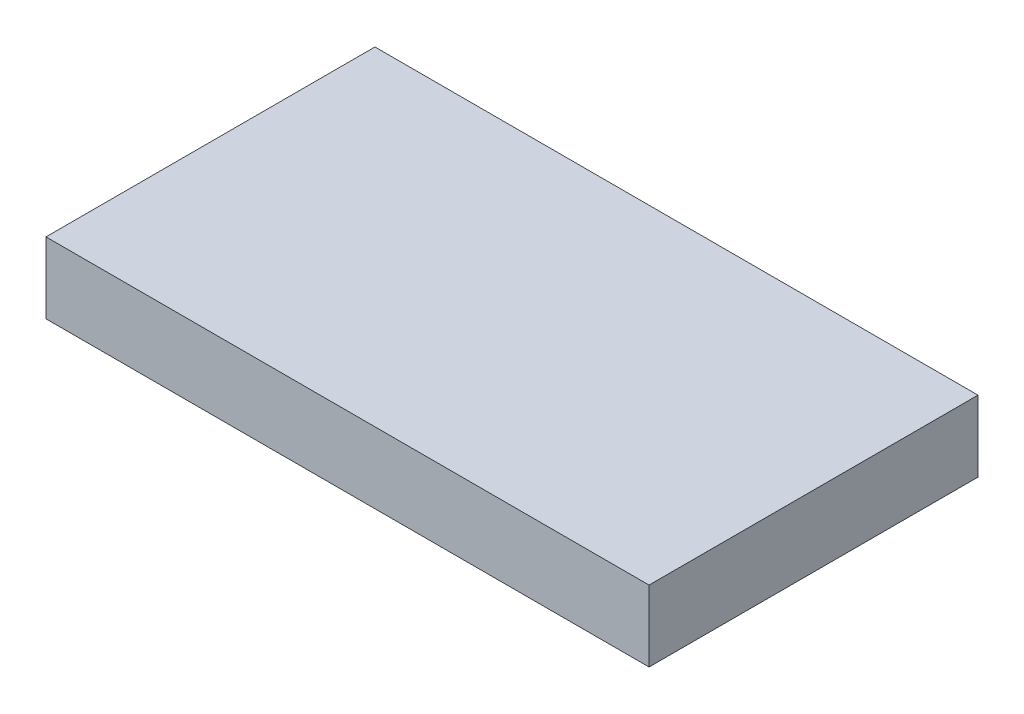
ISO-10303-21;
HEADER;
FILE_DESCRIPTION(('STEP AP214'),'2;1');
FILE_NAME('part.step','',(''),(''),'','','');
FILE_SCHEMA(('AUTOMOTIVE_DESIGN { 1 0 10303 214 1 1 1 1 }'));
ENDSEC;
DATA;
#1=APPLICATION_CONTEXT('core data for automotive mechanical design processes');
#2=APPLICATION_PROTOCOL_DEFINITION('international standard','automotive_design',2000,#1);
#3=PRODUCT_CONTEXT('',#1,'mechanical');
#4=PRODUCT('Part','Part','',(#3));
#5=PRODUCT_RELATED_PRODUCT_CATEGORY('part','',(#4));
#6=PRODUCT_DEFINITION_FORMATION('','',#4);
#7=PRODUCT_DEFINITION_CONTEXT('part definition',#1,'design');
#8=PRODUCT_DEFINITION('design','',#6,#7);
#9=PRODUCT_DEFINITION_SHAPE('','',#8);
#10=(LENGTH_UNIT() NAMED_UNIT(*) SI_UNIT(.MILLI.,.METRE.));
#11=(NAMED_UNIT(*) PLANE_ANGLE_UNIT() SI_UNIT($,.RADIAN.));
#12=(NAMED_UNIT(*) SI_UNIT($,.STERADIAN.) SOLID_ANGLE_UNIT());
#13=UNCERTAINTY_MEASURE_WITH_UNIT(LENGTH_MEASURE(1.E-05),#10,'distance_accuracy_value','');
#14=(GEOMETRIC_REPRESENTATION_CONTEXT(3) GLOBAL_UNCERTAINTY_ASSIGNED_CONTEXT((#13)) GLOBAL_UNIT_ASSIGNED_CONTEXT((#10,
#11,#12)) REPRESENTATION_CONTEXT('',''));
#15=CARTESIAN_POINT('',(0.,0.,0.));
#16=DIRECTION('',(0.,0.,1.));
#17=DIRECTION('',(1.,0.,0.));
#18=AXIS2_PLACEMENT_3D('',#15,#16,#17);
#19=CARTESIAN_POINT('',(0.,1.27000004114E-06,1.20000014));
#20=DIRECTION('',(0.,0.,-1.));
#21=DIRECTION('',(0.,-1.,0.));
#22=AXIS2_PLACEMENT_3D('',#19,#20,#21);
#23=PLANE('',#22);
#24=DIRECTION('',(1.,0.,0.));
#25=VECTOR('',#24,1.);
#26=CARTESIAN_POINT('',(-1.10000034,0.1295019,1.20000014));
#27=LINE('',#26,#25);
#28=CARTESIAN_POINT('',(-1.10000034,0.1295019,1.20000014));
#29=VERTEX_POINT('',#28);
#30=CARTESIAN_POINT('',(1.10000034,0.1295019,1.20000014));
#31=VERTEX_POINT('',#30);
#32=EDGE_CURVE('E20',#29,#31,#27,.T.);
#33=ORIENTED_EDGE('',*,*,#32,.F.);
#34=DIRECTION('',(0.,1.,0.));
#35=VECTOR('',#34,1.);
#36=CARTESIAN_POINT('',(-1.10000034,-0.12949936,1.20000014));
#37=LINE('',#36,#35);
#38=CARTESIAN_POINT('',(-1.10000034,-0.12949936,1.20000014));
#39=VERTEX_POINT('',#38);
#40=EDGE_CURVE('E74',#39,#29,#37,.T.);
#41=ORIENTED_EDGE('',*,*,#40,.F.);
#42=DIRECTION('',(-1.,0.,0.));
#43=VECTOR('',#42,1.);
#44=CARTESIAN_POINT('',(1.10000034,-0.12949936,1.20000014));
#45=LINE('',#44,#43);
#46=CARTESIAN_POINT('',(1.10000034,-0.12949936,1.20000014));
#47=VERTEX_POINT('',#46);
#48=EDGE_CURVE('E68',#47,#39,#45,.T.);
#49=ORIENTED_EDGE('',*,*,#48,.F.);
#50=DIRECTION('',(0.,-1.,0.));
#51=VECTOR('',#50,1.);
#52=CARTESIAN_POINT('',(1.10000034,0.1295019,1.20000014));
#53=LINE('',#52,#51);
#54=EDGE_CURVE('E71',#31,#47,#53,.T.);
#55=ORIENTED_EDGE('',*,*,#54,.F.);
#56=EDGE_LOOP('',(#33,#41,#49,#55));
#57=FACE_BOUND('',#56,.T.);
#58=ADVANCED_FACE('F17',(#57),#23,.F.);
#59=CARTESIAN_POINT('',(0.,1.27000004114E-06,0.));
#60=DIRECTION('',(0.,0.,-1.));
#61=DIRECTION('',(0.,-1.,0.));
#62=AXIS2_PLACEMENT_3D('',#59,#60,#61);
#63=PLANE('',#62);
#64=DIRECTION('',(0.,-1.,0.));
#65=VECTOR('',#64,1.);
#66=CARTESIAN_POINT('',(1.10000034,0.1295019,0.));
#67=LINE('',#66,#65);
#68=CARTESIAN_POINT('',(1.10000034,0.1295019,0.));
#69=VERTEX_POINT('',#68);
#70=CARTESIAN_POINT('',(1.10000034,-0.12949936,0.));
#71=VERTEX_POINT('',#70);
#72=EDGE_CURVE('E80',#69,#71,#67,.T.);
#73=ORIENTED_EDGE('',*,*,#72,.T.);
#74=DIRECTION('',(-1.,0.,0.));
#75=VECTOR('',#74,1.);
#76=CARTESIAN_POINT('',(1.10000034,-0.12949936,0.));
#77=LINE('',#76,#75);
#78=CARTESIAN_POINT('',(-1.10000034,-0.12949936,0.));
#79=VERTEX_POINT('',#78);
#80=EDGE_CURVE('E86',#71,#79,#77,.T.);
#81=ORIENTED_EDGE('',*,*,#80,.T.);
#82=DIRECTION('',(0.,1.,0.));
#83=VECTOR('',#82,1.);
#84=CARTESIAN_POINT('',(-1.10000034,-0.12949936,0.));
#85=LINE('',#84,#83);
#86=CARTESIAN_POINT('',(-1.10000034,0.1295019,0.));
#87=VERTEX_POINT('',#86);
#88=EDGE_CURVE('E111',#79,#87,#85,.T.);
#89=ORIENTED_EDGE('',*,*,#88,.T.);
#90=DIRECTION('',(1.,0.,0.));
#91=VECTOR('',#90,1.);
#92=CARTESIAN_POINT('',(-1.10000034,0.1295019,0.));
#93=LINE('',#92,#91);
#94=EDGE_CURVE('E11',#87,#69,#93,.T.);
#95=ORIENTED_EDGE('',*,*,#94,.T.);
#96=EDGE_LOOP('',(#73,#81,#89,#95));
#97=FACE_BOUND('',#96,.T.);
#98=ADVANCED_FACE('F123',(#97),#63,.T.);
#99=CARTESIAN_POINT('',(-1.10000034,0.1295019,0.));
#100=DIRECTION('',(0.,1.,0.));
#101=DIRECTION('',(1.,0.,0.));
#102=AXIS2_PLACEMENT_3D('',#99,#100,#101);
#103=PLANE('',#102);
#104=DIRECTION('',(0.,0.,1.));
#105=VECTOR('',#104,1.);
#106=CARTESIAN_POINT('',(-1.10000034,0.1295019,0.));
#107=LINE('',#106,#105);
#108=EDGE_CURVE('E109',#87,#29,#107,.T.);
#109=ORIENTED_EDGE('',*,*,#108,.T.);
#110=ORIENTED_EDGE('',*,*,#32,.T.);
#111=DIRECTION('',(0.,0.,1.));
#112=VECTOR('',#111,1.);
#113=CARTESIAN_POINT('',(1.10000034,0.1295019,0.));
#114=LINE('',#113,#112);
#115=EDGE_CURVE('E93',#69,#31,#114,.T.);
#116=ORIENTED_EDGE('',*,*,#115,.F.);
#117=ORIENTED_EDGE('',*,*,#94,.F.);
#118=EDGE_LOOP('',(#109,#110,#116,#117));
#119=FACE_BOUND('',#118,.T.);
#120=ADVANCED_FACE('F120',(#119),#103,.T.);
#121=CARTESIAN_POINT('',(-1.10000034,-0.12949936,0.));
#122=DIRECTION('',(-1.,0.,0.));
#123=DIRECTION('',(0.,0.,1.));
#124=AXIS2_PLACEMENT_3D('',#121,#122,#123);
#125=PLANE('',#124);
#126=DIRECTION('',(0.,0.,1.));
#127=VECTOR('',#126,1.);
#128=CARTESIAN_POINT('',(-1.10000034,-0.12949936,0.));
#129=LINE('',#128,#127);
#130=EDGE_CURVE('E79',#79,#39,#129,.T.);
#131=ORIENTED_EDGE('',*,*,#130,.T.);
#132=ORIENTED_EDGE('',*,*,#40,.T.);
#133=ORIENTED_EDGE('',*,*,#108,.F.);
#134=ORIENTED_EDGE('',*,*,#88,.F.);
#135=EDGE_LOOP('',(#131,#132,#133,#134));
#136=FACE_BOUND('',#135,.T.);
#137=ADVANCED_FACE('F122',(#136),#125,.T.);
#138=CARTESIAN_POINT('',(1.10000034,-0.12949936,0.));
#139=DIRECTION('',(0.,-1.,0.));
#140=DIRECTION('',(0.,0.,-1.));
#141=AXIS2_PLACEMENT_3D('',#138,#139,#140);
#142=PLANE('',#141);
#143=DIRECTION('',(0.,0.,1.));
#144=VECTOR('',#143,1.);
#145=CARTESIAN_POINT('',(1.10000034,-0.12949936,0.));
#146=LINE('',#145,#144);
#147=EDGE_CURVE('E83',#71,#47,#146,.T.);
#148=ORIENTED_EDGE('',*,*,#147,.T.);
#149=ORIENTED_EDGE('',*,*,#48,.T.);
#150=ORIENTED_EDGE('',*,*,#130,.F.);
#151=ORIENTED_EDGE('',*,*,#80,.F.);
#152=EDGE_LOOP('',(#148,#149,#150,#151));
#153=FACE_BOUND('',#152,.T.);
#154=ADVANCED_FACE('F84',(#153),#142,.T.);
#155=CARTESIAN_POINT('',(1.10000034,0.1295019,0.));
#156=DIRECTION('',(1.,0.,0.));
#157=DIRECTION('',(0.,1.,0.));
#158=AXIS2_PLACEMENT_3D('',#155,#156,#157);
#159=PLANE('',#158);
#160=ORIENTED_EDGE('',*,*,#115,.T.);
#161=ORIENTED_EDGE('',*,*,#54,.T.);
#162=ORIENTED_EDGE('',*,*,#147,.F.);
#163=ORIENTED_EDGE('',*,*,#72,.F.);
#164=EDGE_LOOP('',(#160,#161,#162,#163));
#165=FACE_BOUND('',#164,.T.);
#166=ADVANCED_FACE('F92',(#165),#159,.T.);
#167=CLOSED_SHELL('',(#58,#98,#120,#137,#154,#166));
#168=MANIFOLD_SOLID_BREP('B1',#167);
#169=ADVANCED_BREP_SHAPE_REPRESENTATION('',(#18,#168),#14);
#170=SHAPE_DEFINITION_REPRESENTATION(#9,#169);
ENDSEC;
END-ISO-10303-21;
